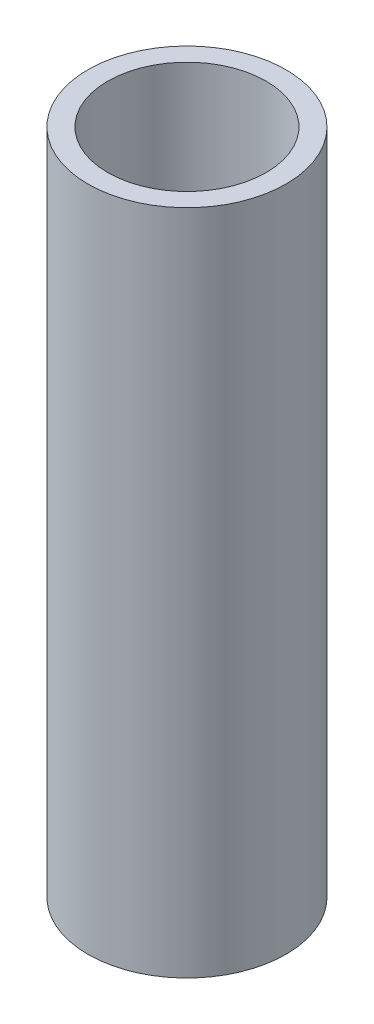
from build123d import *

# Parameters (mm, degrees)
SKETCH1_R           = 15.875
SKETCH1_R_2         = 12.7
BOSS_EXTRUDE1_DEPTH = 53.467


with BuildPart() as part:
    # Sketch1 → Boss-Extrude1 (new, symmetric)
    with BuildSketch(Plane(origin=(0, 0, 0), x_dir=(1, 0, 0), z_dir=(0, 1, 0))):
        with Locations(Location((0, 0, 0), (0, 0, 270))):
            Circle(SKETCH1_R)
        with Locations(Location((0, 0, 0), (0, 0, 270))):
            Circle(SKETCH1_R_2, mode=Mode.SUBTRACT)
    extrude(amount=BOSS_EXTRUDE1_DEPTH, both=True)


solid = part.part
